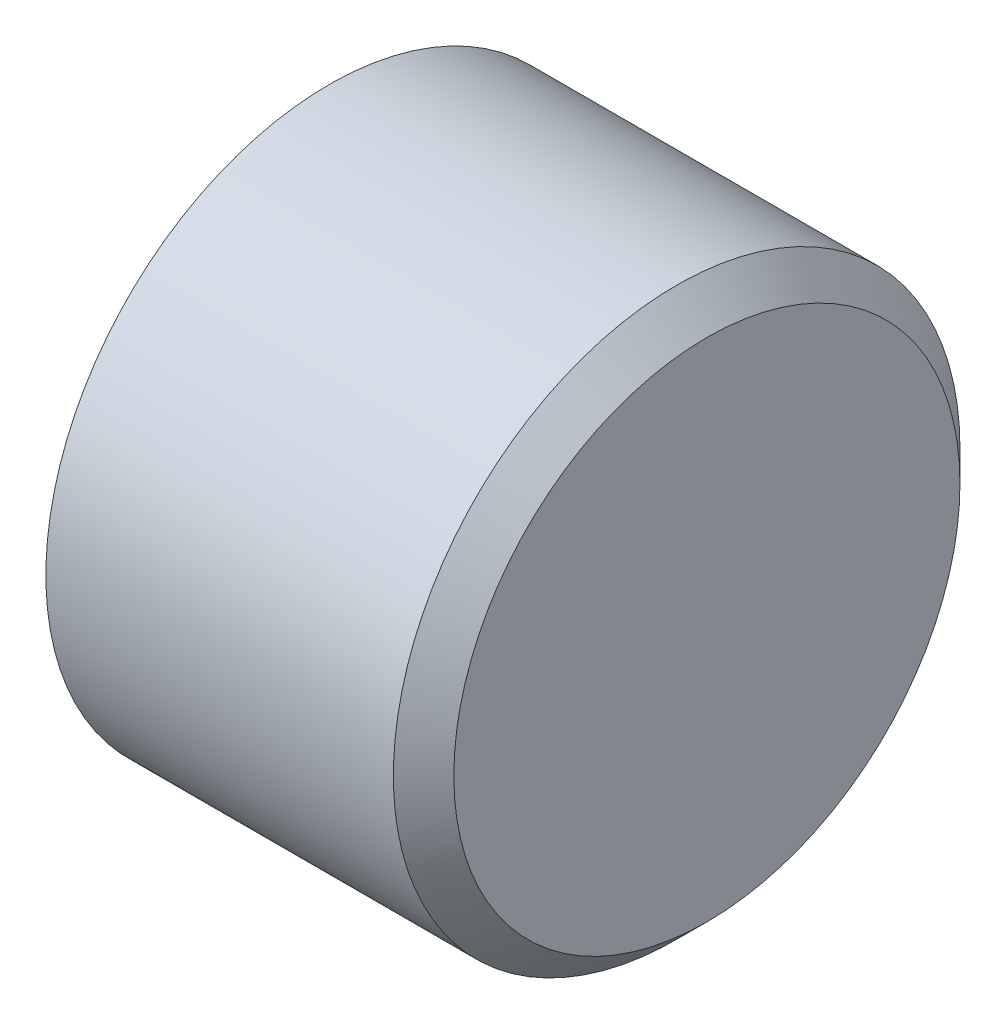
from build123d import *

# Parameters (mm, degrees)
CHAMFER1_SIZE = 1.016


with BuildPart() as part:
    # Sketch1 → Revolve1 (revolve)
    with BuildSketch(Plane.XY, mode=Mode.PRIVATE) as revolve1_sk:
        Polygon((0, 3.175), (0, 9.525), (12.7, 9.525), (12.7, 0), (9.525, 0), (9.525, 3.175), align=None)
    revolve(revolve1_sk.sketch.rotate(Axis((0, 0, 0), (-1, 0, 0)), 90), axis=Axis((0, 0, 0), (-1, 0, 0)))

    # Chamfer1
    chamfer1_edges = [part.edges().sort_by_distance(p)[0] for p in [
        (12.7, 0, 9.525),
    ]]
    chamfer(chamfer1_edges, length=CHAMFER1_SIZE)


solid = part.part
